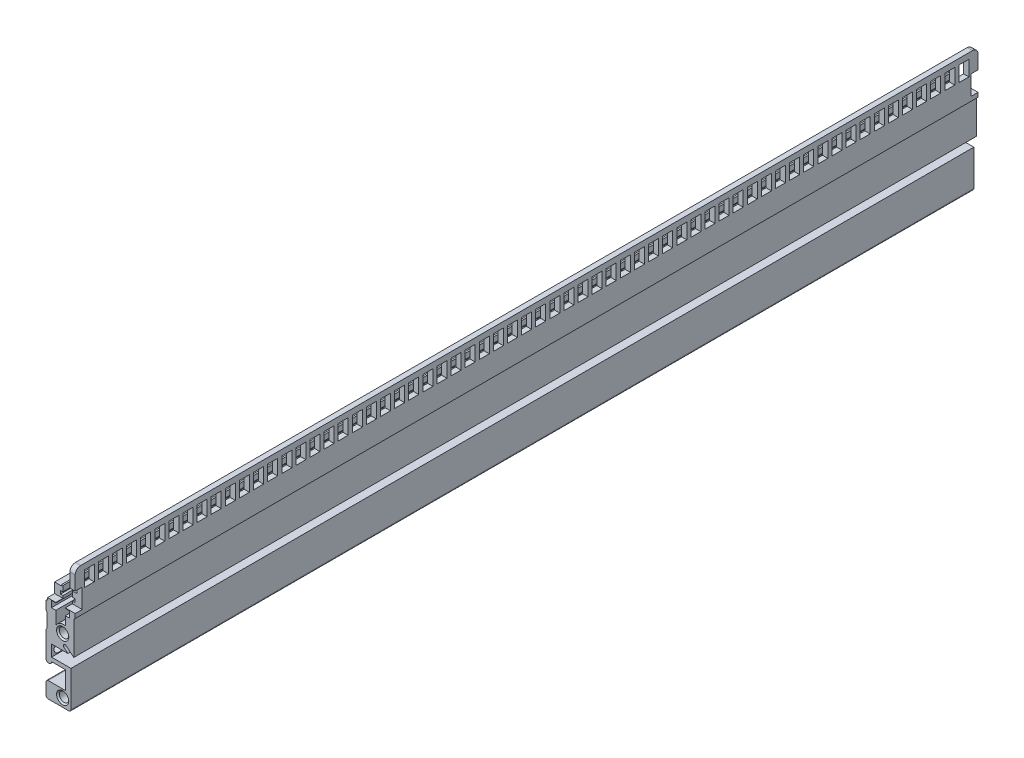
from build123d import *

# Parameters (mm, degrees)
SKETCH_1_R          = 1.7
EXTRUDE_1_DEPTH     = 325.12
FILLET_1_R          = 2
SKETCH_2_W          = 3.6
SKETCH_2_H          = 5.5
CUT_EXTRUDE_1_DEPTH = 1.9
SKETCH_3_W          = 2.54
SKETCH_3_H          = 7
CUT_EXTRUDE_2_DEPTH = 327.101616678
SKETCH_4_R          = 1.65
CUT_EXTRUDE_3_DEPTH = 2
CHAMFER_1_SIZE      = 0.5
CHAMFER_2_SIZE      = 0.5


with BuildPart() as part:
    # Sketch 1 → Extrude 1 (new body)
    with BuildSketch(Plane.XY):
        with BuildLine():
            Line((2.6, 12.5), (2.6, 22.5))
            Line((2.6, 22.5), (4.5, 22.5))
            Line((4.5, 22.5), (4.5, 6.95))
            Line((4.5, 6.95), (4, 6.45))
            Line((4, 6.45), (4, -5.445811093))
            Line((4, -5.445811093), (1.222426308, -3.115150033))
            ThreePointArc((1.222426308, -3.115150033), (0.377127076, -3.189104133), (0.451081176, -4.034403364))
            Line((0.451081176, -4.034403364), (1.899772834, -5.25))
            Line((1.899772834, -5.25), (-4, -5.25))
            Line((-4, -5.25), (-4, -9.35))
            Line((-4, -9.35), (3, -9.35))
            Line((3, -9.35), (3, -22.2))
            ThreePointArc((3, -22.2), (2.765685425, -22.765685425), (2.2, -23))
            Line((2.2, -23), (-5.2, -23))
            ThreePointArc((-5.2, -23), (-5.765685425, -22.765685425), (-6, -22.2))
            Line((-6, -22.2), (-6, -18.05))
            ThreePointArc((-6, -18.05), (-5.765685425, -17.484314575), (-5.2, -17.25))
            Line((-5.2, -17.25), (1, -17.25))
            Line((1, -17.25), (1, -10.75))
            Line((1, -10.75), (-4, -10.75))
            ThreePointArc((-4, -10.75), (-5, -11.75), (-6, -10.75))
            Line((-6, -10.75), (-6, -1.6))
            Line((-6, -1.6), (-5.550132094, -1.100195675))
            Line((-5.550132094, -1.100195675), (-5.549867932, 3.899804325))
            Line((-5.549867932, 3.899804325), (-6, 4.4))
            Line((-6, 4.4), (-6, 7.4))
            Line((-6, 7.4), (-5.7, 7.7))
            Line((-5.7, 7.7), (-5.45, 7.7))
            Line((-5.45, 7.7), (-5.45, 12.1))
            Line((-5.45, 12.1), (-3, 12.1))
            Line((-3, 12.1), (-3, 12.5))
            Line((-3, 12.5), (-2.45, 12.5))
            Line((-2.45, 12.5), (-2.45, 10.55))
            Line((-2.45, 10.55), (-3.35, 10.55))
            Line((-3.35, 10.55), (-3.35, 9.35))
            Line((-3.35, 9.35), (-2.45, 9.35))
            Line((-2.45, 9.35), (-2.45, 8.35))
            Line((-2.45, 8.35), (-4.05, 8.35))
            Line((-4.05, 8.35), (-4.05, 6.05))
            Line((-4.05, 6.05), (-2.45, 6.05))
            Line((-2.45, 6.05), (-2.45, 1.307669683))
            ThreePointArc((-2.45, 1.307669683), (-1.033604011, 2.711523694), (0.95, 2.917190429))
            Line((0.95, 2.917190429), (0.95, 6.05))
            Line((0.95, 6.05), (2.55, 6.05))
            Line((2.55, 6.05), (2.55, 8.35))
            Line((2.55, 8.35), (0.95, 8.35))
            Line((0.95, 8.35), (0.95, 9.35))
            Line((0.95, 9.35), (1.85, 9.35))
            Line((1.85, 9.35), (1.85, 10.55))
            Line((1.85, 10.55), (0.95, 10.55))
            Line((0.95, 10.55), (0.95, 12.5))
            Line((0.95, 12.5), (2.6, 12.5))
        make_face()
        Circle(SKETCH_1_R, mode=Mode.SUBTRACT)
        with Locations((0, -20)):
            Circle(SKETCH_1_R, mode=Mode.SUBTRACT)
    extrude(amount=-EXTRUDE_1_DEPTH)

    # Fillet 1
    fillet_1_edges = [part.edges().sort_by_distance(p)[0] for p in [
        (3.55, 22.5, -325.12),
        (3.55, 22.5, 0),
    ]]
    fillet(fillet_1_edges, radius=FILLET_1_R)

    # Sketch 2 → Cut-Extrude 1 (cut)
    with BuildSketch(Plane(origin=(4.5, 0, 0), x_dir=(0, 0, -1), z_dir=(1, 0, 0))):
        with Locations((10.16, 17.7)):
            Rectangle(SKETCH_2_W, SKETCH_2_H)
        with Locations((5.08, 17.7)):
            Rectangle(SKETCH_2_W, SKETCH_2_H)
        with Locations((15.24, 17.7)):
            Rectangle(SKETCH_2_W, SKETCH_2_H)
        with Locations((20.32, 17.7)):
            Rectangle(SKETCH_2_W, SKETCH_2_H)
        with Locations((25.4, 17.7)):
            Rectangle(SKETCH_2_W, SKETCH_2_H)
        with Locations((30.48, 17.7)):
            Rectangle(SKETCH_2_W, SKETCH_2_H)
        with Locations((35.56, 17.7)):
            Rectangle(SKETCH_2_W, SKETCH_2_H)
        with Locations((40.64, 17.7)):
            Rectangle(SKETCH_2_W, SKETCH_2_H)
        with Locations((45.72, 17.7)):
            Rectangle(SKETCH_2_W, SKETCH_2_H)
        with Locations((50.8, 17.7)):
            Rectangle(SKETCH_2_W, SKETCH_2_H)
        with Locations((55.88, 17.7)):
            Rectangle(SKETCH_2_W, SKETCH_2_H)
        with Locations((60.96, 17.7)):
            Rectangle(SKETCH_2_W, SKETCH_2_H)
        with Locations((66.04, 17.7)):
            Rectangle(SKETCH_2_W, SKETCH_2_H)
        with Locations((71.12, 17.7)):
            Rectangle(SKETCH_2_W, SKETCH_2_H)
        with Locations((76.2, 17.7)):
            Rectangle(SKETCH_2_W, SKETCH_2_H)
        with Locations((81.28, 17.7)):
            Rectangle(SKETCH_2_W, SKETCH_2_H)
        with Locations((86.36, 17.7)):
            Rectangle(SKETCH_2_W, SKETCH_2_H)
        with Locations((91.44, 17.7)):
            Rectangle(SKETCH_2_W, SKETCH_2_H)
        with Locations((96.52, 17.7)):
            Rectangle(SKETCH_2_W, SKETCH_2_H)
        with Locations((101.6, 17.7)):
            Rectangle(SKETCH_2_W, SKETCH_2_H)
        with Locations((106.68, 17.7)):
            Rectangle(SKETCH_2_W, SKETCH_2_H)
        with Locations((111.76, 17.7)):
            Rectangle(SKETCH_2_W, SKETCH_2_H)
        with Locations((116.84, 17.7)):
            Rectangle(SKETCH_2_W, SKETCH_2_H)
        with Locations((121.92, 17.7)):
            Rectangle(SKETCH_2_W, SKETCH_2_H)
        with Locations((127, 17.7)):
            Rectangle(SKETCH_2_W, SKETCH_2_H)
        with Locations((132.08, 17.7)):
            Rectangle(SKETCH_2_W, SKETCH_2_H)
        with Locations((137.16, 17.7)):
            Rectangle(SKETCH_2_W, SKETCH_2_H)
        with Locations((142.24, 17.7)):
            Rectangle(SKETCH_2_W, SKETCH_2_H)
        with Locations((147.32, 17.7)):
            Rectangle(SKETCH_2_W, SKETCH_2_H)
        with Locations((152.4, 17.7)):
            Rectangle(SKETCH_2_W, SKETCH_2_H)
        with Locations((157.48, 17.7)):
            Rectangle(SKETCH_2_W, SKETCH_2_H)
        with Locations((162.56, 17.7)):
            Rectangle(SKETCH_2_W, SKETCH_2_H)
        with Locations((167.64, 17.7)):
            Rectangle(SKETCH_2_W, SKETCH_2_H)
        with Locations((172.72, 17.7)):
            Rectangle(SKETCH_2_W, SKETCH_2_H)
        with Locations((177.8, 17.7)):
            Rectangle(SKETCH_2_W, SKETCH_2_H)
        with Locations((182.88, 17.7)):
            Rectangle(SKETCH_2_W, SKETCH_2_H)
        with Locations((187.96, 17.7)):
            Rectangle(SKETCH_2_W, SKETCH_2_H)
        with Locations((193.04, 17.7)):
            Rectangle(SKETCH_2_W, SKETCH_2_H)
        with Locations((198.12, 17.7)):
            Rectangle(SKETCH_2_W, SKETCH_2_H)
        with Locations((203.2, 17.7)):
            Rectangle(SKETCH_2_W, SKETCH_2_H)
        with Locations((208.28, 17.7)):
            Rectangle(SKETCH_2_W, SKETCH_2_H)
        with Locations((213.36, 17.7)):
            Rectangle(SKETCH_2_W, SKETCH_2_H)
        with Locations((218.44, 17.7)):
            Rectangle(SKETCH_2_W, SKETCH_2_H)
        with Locations((223.52, 17.7)):
            Rectangle(SKETCH_2_W, SKETCH_2_H)
        with Locations((228.6, 17.7)):
            Rectangle(SKETCH_2_W, SKETCH_2_H)
        with Locations((233.68, 17.7)):
            Rectangle(SKETCH_2_W, SKETCH_2_H)
        with Locations((238.76, 17.7)):
            Rectangle(SKETCH_2_W, SKETCH_2_H)
        with Locations((243.84, 17.7)):
            Rectangle(SKETCH_2_W, SKETCH_2_H)
        with Locations((248.92, 17.7)):
            Rectangle(SKETCH_2_W, SKETCH_2_H)
        with Locations((254, 17.7)):
            Rectangle(SKETCH_2_W, SKETCH_2_H)
        with Locations((259.08, 17.7)):
            Rectangle(SKETCH_2_W, SKETCH_2_H)
        with Locations((264.16, 17.7)):
            Rectangle(SKETCH_2_W, SKETCH_2_H)
        with Locations((269.24, 17.7)):
            Rectangle(SKETCH_2_W, SKETCH_2_H)
        with Locations((274.32, 17.7)):
            Rectangle(SKETCH_2_W, SKETCH_2_H)
        with Locations((279.4, 17.7)):
            Rectangle(SKETCH_2_W, SKETCH_2_H)
        with Locations((284.48, 17.7)):
            Rectangle(SKETCH_2_W, SKETCH_2_H)
        with Locations((289.56, 17.7)):
            Rectangle(SKETCH_2_W, SKETCH_2_H)
        with Locations((294.64, 17.7)):
            Rectangle(SKETCH_2_W, SKETCH_2_H)
        with Locations((299.72, 17.7)):
            Rectangle(SKETCH_2_W, SKETCH_2_H)
        with Locations((304.8, 17.7)):
            Rectangle(SKETCH_2_W, SKETCH_2_H)
        with Locations((309.88, 17.7)):
            Rectangle(SKETCH_2_W, SKETCH_2_H)
        with Locations((314.96, 17.7)):
            Rectangle(SKETCH_2_W, SKETCH_2_H)
        with Locations((320.04, 17.7)):
            Rectangle(SKETCH_2_W, SKETCH_2_H)
    extrude(amount=-CUT_EXTRUDE_1_DEPTH, mode=Mode.SUBTRACT)

    # Sketch 3 → Cut-Extrude 2 (cut, through all)
    with BuildSketch(Plane(origin=(4.5, 0, 0), x_dir=(0, 0, -1), z_dir=(1, 0, 0))):
        with Locations((1.27, 12)):
            Rectangle(SKETCH_3_W, SKETCH_3_H)
    cut_extrude_2 = extrude(amount=-CUT_EXTRUDE_2_DEPTH, mode=Mode.SUBTRACT)

    # Mirror 1: Cut-Extrude 2 across plane
    add(cut_extrude_2.mirror(Plane.XY.offset(-162.56)), mode=Mode.SUBTRACT)

    # Sketch 4 → Cut-Extrude 3 (cut)
    with BuildSketch(Plane.ZY.offset(6)):
        with Locations((-322.58, -7.45)):
            Circle(SKETCH_4_R)
        with Locations((-317.5, -7.45)):
            Circle(SKETCH_4_R)
        with Locations((-312.42, -7.45)):
            Circle(SKETCH_4_R)
        with Locations((-307.34, -7.45)):
            Circle(SKETCH_4_R)
        with Locations((-302.26, -7.45)):
            Circle(SKETCH_4_R)
        with Locations((-297.18, -7.45)):
            Circle(SKETCH_4_R)
        with Locations((-292.1, -7.45)):
            Circle(SKETCH_4_R)
        with Locations((-287.02, -7.45)):
            Circle(SKETCH_4_R)
        with Locations((-281.94, -7.45)):
            Circle(SKETCH_4_R)
        with Locations((-276.86, -7.45)):
            Circle(SKETCH_4_R)
        with Locations((-271.78, -7.45)):
            Circle(SKETCH_4_R)
        with Locations((-266.7, -7.45)):
            Circle(SKETCH_4_R)
        with Locations((-261.62, -7.45)):
            Circle(SKETCH_4_R)
        with Locations((-256.54, -7.45)):
            Circle(SKETCH_4_R)
        with Locations((-251.46, -7.45)):
            Circle(SKETCH_4_R)
        with Locations((-246.38, -7.45)):
            Circle(SKETCH_4_R)
        with Locations((-241.3, -7.45)):
            Circle(SKETCH_4_R)
        with Locations((-236.22, -7.45)):
            Circle(SKETCH_4_R)
        with Locations((-231.14, -7.45)):
            Circle(SKETCH_4_R)
        with Locations((-226.06, -7.45)):
            Circle(SKETCH_4_R)
        with Locations((-220.98, -7.45)):
            Circle(SKETCH_4_R)
        with Locations((-215.9, -7.45)):
            Circle(SKETCH_4_R)
        with Locations((-210.82, -7.45)):
            Circle(SKETCH_4_R)
        with Locations((-205.74, -7.45)):
            Circle(SKETCH_4_R)
        with Locations((-200.66, -7.45)):
            Circle(SKETCH_4_R)
        with Locations((-195.58, -7.45)):
            Circle(SKETCH_4_R)
        with Locations((-190.5, -7.45)):
            Circle(SKETCH_4_R)
        with Locations((-185.42, -7.45)):
            Circle(SKETCH_4_R)
        with Locations((-180.34, -7.45)):
            Circle(SKETCH_4_R)
        with Locations((-175.26, -7.45)):
            Circle(SKETCH_4_R)
        with Locations((-170.18, -7.45)):
            Circle(SKETCH_4_R)
        with Locations((-165.1, -7.45)):
            Circle(SKETCH_4_R)
        with Locations((-160.02, -7.45)):
            Circle(SKETCH_4_R)
        with Locations((-154.94, -7.45)):
            Circle(SKETCH_4_R)
        with Locations((-149.86, -7.45)):
            Circle(SKETCH_4_R)
        with Locations((-144.78, -7.45)):
            Circle(SKETCH_4_R)
        with Locations((-139.7, -7.45)):
            Circle(SKETCH_4_R)
        with Locations((-134.62, -7.45)):
            Circle(SKETCH_4_R)
        with Locations((-129.54, -7.45)):
            Circle(SKETCH_4_R)
        with Locations((-124.46, -7.45)):
            Circle(SKETCH_4_R)
        with Locations((-119.38, -7.45)):
            Circle(SKETCH_4_R)
        with Locations((-114.3, -7.45)):
            Circle(SKETCH_4_R)
        with Locations((-109.22, -7.45)):
            Circle(SKETCH_4_R)
        with Locations((-104.14, -7.45)):
            Circle(SKETCH_4_R)
        with Locations((-99.06, -7.45)):
            Circle(SKETCH_4_R)
        with Locations((-93.98, -7.45)):
            Circle(SKETCH_4_R)
        with Locations((-88.9, -7.45)):
            Circle(SKETCH_4_R)
        with Locations((-83.82, -7.45)):
            Circle(SKETCH_4_R)
        with Locations((-78.74, -7.45)):
            Circle(SKETCH_4_R)
        with Locations((-73.66, -7.45)):
            Circle(SKETCH_4_R)
        with Locations((-68.58, -7.45)):
            Circle(SKETCH_4_R)
        with Locations((-63.5, -7.45)):
            Circle(SKETCH_4_R)
        with Locations((-58.42, -7.45)):
            Circle(SKETCH_4_R)
        with Locations((-53.34, -7.45)):
            Circle(SKETCH_4_R)
        with Locations((-48.26, -7.45)):
            Circle(SKETCH_4_R)
        with Locations((-43.18, -7.45)):
            Circle(SKETCH_4_R)
        with Locations((-38.1, -7.45)):
            Circle(SKETCH_4_R)
        with Locations((-33.02, -7.45)):
            Circle(SKETCH_4_R)
        with Locations((-27.94, -7.45)):
            Circle(SKETCH_4_R)
        with Locations((-22.86, -7.45)):
            Circle(SKETCH_4_R)
        with Locations((-17.78, -7.45)):
            Circle(SKETCH_4_R)
        with Locations((-12.7, -7.45)):
            Circle(SKETCH_4_R)
        with Locations((-7.62, -7.45)):
            Circle(SKETCH_4_R)
        with Locations((-2.54, -7.45)):
            Circle(SKETCH_4_R)
    extrude(amount=-CUT_EXTRUDE_3_DEPTH, mode=Mode.SUBTRACT)

    # Chamfer 1
    chamfer_1_edges = [part.edges().sort_by_distance(p)[0] for p in [
        (-1.7, 0, -325.12),
        (-1.7, 0, 0),
        (-1.7, -20, 0),
    ]]
    chamfer(chamfer_1_edges, length=CHAMFER_1_SIZE)

    # Chamfer 2
    chamfer_2_edges = [part.edges().sort_by_distance(p)[0] for p in [
        (-1.7, -20, -325.12),
    ]]
    chamfer(chamfer_2_edges, length=CHAMFER_2_SIZE)


solid = part.part
